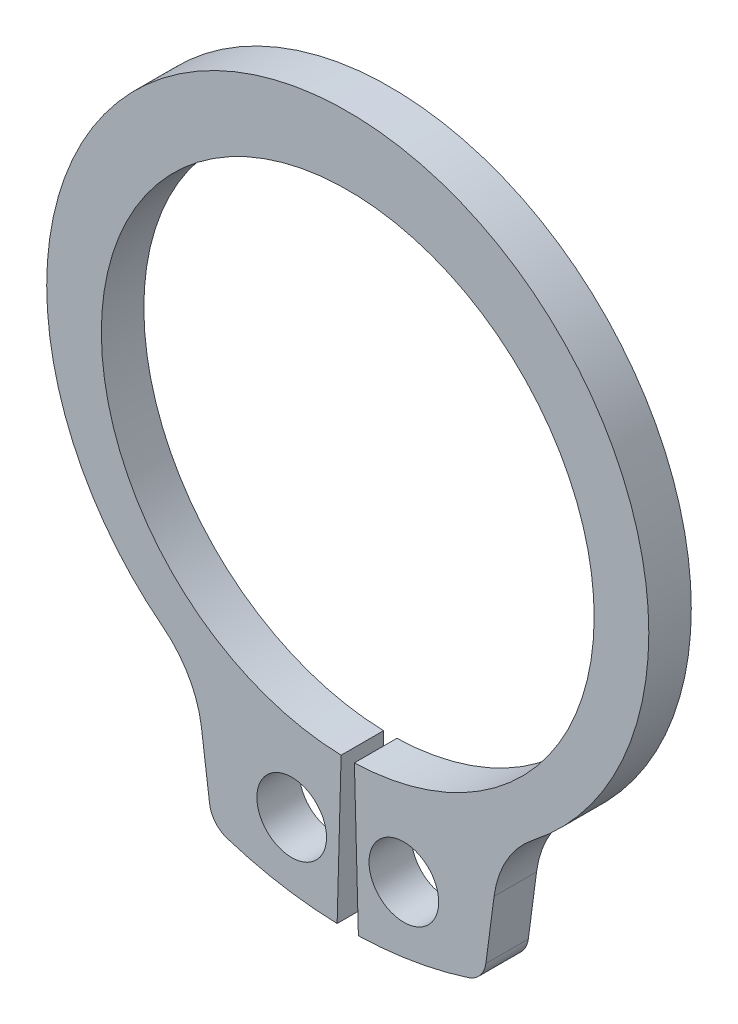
from build123d import *

# Parameters (mm, degrees)
BODYSKE_R  = 0.5207
BODY_DEPTH = 0.635


with BuildPart() as part:
    # BodySke → Body (new body)
    with BuildSketch(Plane.XY):
        with BuildLine():
            Line((0.09921875, -3.681663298), (0.15875, -5.890661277))
            ThreePointArc((0.15875, -5.890661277), (0.990844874, -5.80889992), (1.802992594, -5.610196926))
            ThreePointArc((1.802992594, -5.610196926), (1.9789575, -5.491564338), (2.064160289, -5.297199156))
            Line((2.064160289, -5.297199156), (2.186751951, -4.366023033))
            ThreePointArc((2.186751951, -4.366023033), (2.377771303, -3.799381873), (2.769194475, -3.347321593))
            ThreePointArc((2.769194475, -3.347321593), (0, 4.699), (-2.769194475, -3.347321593))
            ThreePointArc((-2.769194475, -3.347321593), (-2.377771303, -3.799381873), (-2.186751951, -4.366023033))
            Line((-2.186751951, -4.366023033), (-2.064160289, -5.297199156))
            ThreePointArc((-2.064160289, -5.297199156), (-1.9789575, -5.491564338), (-1.802992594, -5.610196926))
            ThreePointArc((-1.802992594, -5.610196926), (-0.990844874, -5.80889992), (-0.15875, -5.890661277))
            Line((-0.15875, -5.890661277), (-0.09921875, -3.681663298))
            ThreePointArc((-0.09921875, -3.681663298), (0, 3.683), (0.09921875, -3.681663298))
        make_face()
        with Locations((0.8382, -4.855786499)):
            Circle(BODYSKE_R, mode=Mode.SUBTRACT)
        with Locations((-0.8382, -4.855786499)):
            Circle(BODYSKE_R, mode=Mode.SUBTRACT)
    extrude(amount=-BODY_DEPTH)


solid = part.part
